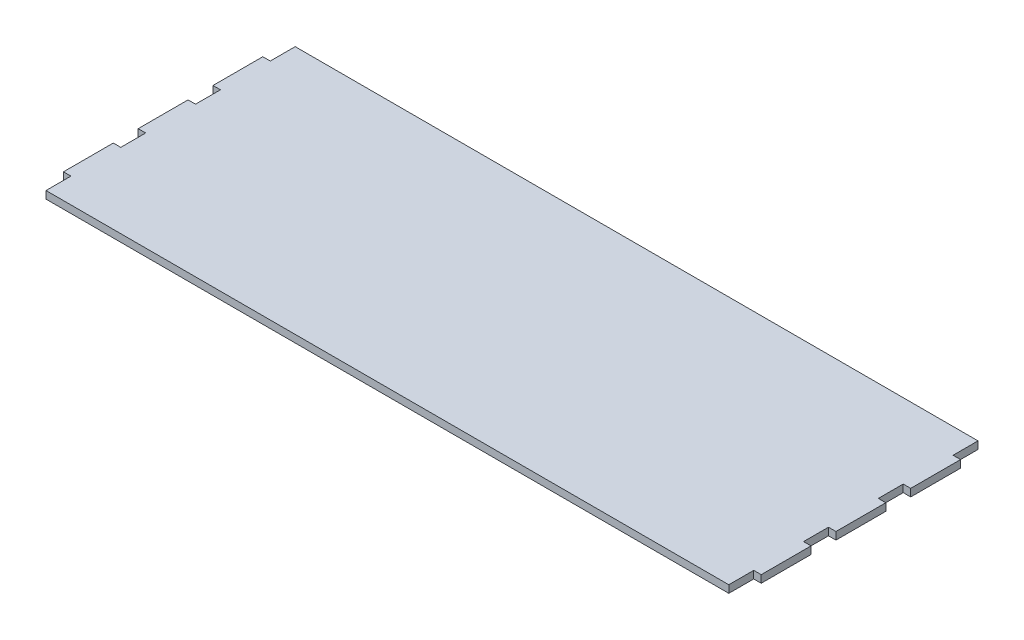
ISO-10303-21;
HEADER;
FILE_DESCRIPTION(('STEP AP214'),'2;1');
FILE_NAME('part.step','',(''),(''),'','','');
FILE_SCHEMA(('AUTOMOTIVE_DESIGN { 1 0 10303 214 1 1 1 1 }'));
ENDSEC;
DATA;
#1=APPLICATION_CONTEXT('core data for automotive mechanical design processes');
#2=APPLICATION_PROTOCOL_DEFINITION('international standard','automotive_design',2000,#1);
#3=PRODUCT_CONTEXT('',#1,'mechanical');
#4=PRODUCT('Part','Part','',(#3));
#5=PRODUCT_RELATED_PRODUCT_CATEGORY('part','',(#4));
#6=PRODUCT_DEFINITION_FORMATION('','',#4);
#7=PRODUCT_DEFINITION_CONTEXT('part definition',#1,'design');
#8=PRODUCT_DEFINITION('design','',#6,#7);
#9=PRODUCT_DEFINITION_SHAPE('','',#8);
#10=(LENGTH_UNIT() NAMED_UNIT(*) SI_UNIT(.MILLI.,.METRE.));
#11=(NAMED_UNIT(*) PLANE_ANGLE_UNIT() SI_UNIT($,.RADIAN.));
#12=(NAMED_UNIT(*) SI_UNIT($,.STERADIAN.) SOLID_ANGLE_UNIT());
#13=UNCERTAINTY_MEASURE_WITH_UNIT(LENGTH_MEASURE(1.E-05),#10,'distance_accuracy_value','');
#14=(GEOMETRIC_REPRESENTATION_CONTEXT(3) GLOBAL_UNCERTAINTY_ASSIGNED_CONTEXT((#13)) GLOBAL_UNIT_ASSIGNED_CONTEXT((#10,
#11,#12)) REPRESENTATION_CONTEXT('',''));
#15=CARTESIAN_POINT('',(0.,0.,0.));
#16=DIRECTION('',(0.,0.,1.));
#17=DIRECTION('',(1.,0.,0.));
#18=AXIS2_PLACEMENT_3D('',#15,#16,#17);
#19=CARTESIAN_POINT('',(548.000000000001,12.,-159.999999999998));
#20=DIRECTION('',(-1.,0.,0.));
#21=DIRECTION('',(0.,0.,1.));
#22=AXIS2_PLACEMENT_3D('',#19,#20,#21);
#23=PLANE('',#22);
#24=DIRECTION('',(0.,0.,-1.));
#25=VECTOR('',#24,1.);
#26=CARTESIAN_POINT('',(548.000000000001,0.,-159.999999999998));
#27=LINE('',#26,#25);
#28=CARTESIAN_POINT('',(548.000000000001,0.,-159.999999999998));
#29=VERTEX_POINT('',#28);
#30=CARTESIAN_POINT('',(548.,0.,-200.));
#31=VERTEX_POINT('',#30);
#32=EDGE_CURVE('E266',#29,#31,#27,.T.);
#33=ORIENTED_EDGE('',*,*,#32,.T.);
#34=DIRECTION('',(0.,-1.,0.));
#35=VECTOR('',#34,1.);
#36=CARTESIAN_POINT('',(548.,12.,-200.));
#37=LINE('',#36,#35);
#38=CARTESIAN_POINT('',(548.,12.,-200.));
#39=VERTEX_POINT('',#38);
#40=EDGE_CURVE('E11',#39,#31,#37,.T.);
#41=ORIENTED_EDGE('',*,*,#40,.F.);
#42=DIRECTION('',(0.,0.,-1.));
#43=VECTOR('',#42,1.);
#44=CARTESIAN_POINT('',(548.000000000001,12.,-159.999999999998));
#45=LINE('',#44,#43);
#46=CARTESIAN_POINT('',(548.000000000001,12.,-159.999999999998));
#47=VERTEX_POINT('',#46);
#48=EDGE_CURVE('E348',#47,#39,#45,.T.);
#49=ORIENTED_EDGE('',*,*,#48,.F.);
#50=DIRECTION('',(0.,-1.,0.));
#51=VECTOR('',#50,1.);
#52=CARTESIAN_POINT('',(548.000000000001,12.,-159.999999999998));
#53=LINE('',#52,#51);
#54=EDGE_CURVE('E262',#47,#29,#53,.T.);
#55=ORIENTED_EDGE('',*,*,#54,.T.);
#56=EDGE_LOOP('',(#33,#41,#49,#55));
#57=FACE_BOUND('',#56,.T.);
#58=ADVANCED_FACE('F45',(#57),#23,.F.);
#59=CARTESIAN_POINT('',(-548.,12.,-200.));
#60=DIRECTION('',(0.,0.,1.));
#61=DIRECTION('',(1.,0.,0.));
#62=AXIS2_PLACEMENT_3D('',#59,#60,#61);
#63=PLANE('',#62);
#64=DIRECTION('',(-1.,0.,0.));
#65=VECTOR('',#64,1.);
#66=CARTESIAN_POINT('',(-548.,0.,-200.));
#67=LINE('',#66,#65);
#68=CARTESIAN_POINT('',(-548.,0.,-200.));
#69=VERTEX_POINT('',#68);
#70=EDGE_CURVE('E270',#31,#69,#67,.T.);
#71=ORIENTED_EDGE('',*,*,#70,.T.);
#72=DIRECTION('',(0.,-1.,0.));
#73=VECTOR('',#72,1.);
#74=CARTESIAN_POINT('',(-548.,12.,-200.));
#75=LINE('',#74,#73);
#76=CARTESIAN_POINT('',(-548.,12.,-200.));
#77=VERTEX_POINT('',#76);
#78=EDGE_CURVE('E54',#77,#69,#75,.T.);
#79=ORIENTED_EDGE('',*,*,#78,.F.);
#80=DIRECTION('',(-1.,0.,0.));
#81=VECTOR('',#80,1.);
#82=CARTESIAN_POINT('',(-548.,12.,-200.));
#83=LINE('',#82,#81);
#84=EDGE_CURVE('E165',#39,#77,#83,.T.);
#85=ORIENTED_EDGE('',*,*,#84,.F.);
#86=ORIENTED_EDGE('',*,*,#40,.T.);
#87=EDGE_LOOP('',(#71,#79,#85,#86));
#88=FACE_BOUND('',#87,.T.);
#89=ADVANCED_FACE('F554',(#88),#63,.F.);
#90=CARTESIAN_POINT('',(-548.000000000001,12.,-160.));
#91=DIRECTION('',(1.,0.,0.));
#92=DIRECTION('',(0.,0.,-1.));
#93=AXIS2_PLACEMENT_3D('',#90,#91,#92);
#94=PLANE('',#93);
#95=DIRECTION('',(0.,0.,1.));
#96=VECTOR('',#95,1.);
#97=CARTESIAN_POINT('',(-548.000000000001,0.,-160.));
#98=LINE('',#97,#96);
#99=CARTESIAN_POINT('',(-548.000000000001,0.,-160.));
#100=VERTEX_POINT('',#99);
#101=EDGE_CURVE('E273',#69,#100,#98,.T.);
#102=ORIENTED_EDGE('',*,*,#101,.T.);
#103=DIRECTION('',(0.,-1.,0.));
#104=VECTOR('',#103,1.);
#105=CARTESIAN_POINT('',(-548.000000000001,12.,-160.));
#106=LINE('',#105,#104);
#107=CARTESIAN_POINT('',(-548.000000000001,12.,-160.));
#108=VERTEX_POINT('',#107);
#109=EDGE_CURVE('E439',#108,#100,#106,.T.);
#110=ORIENTED_EDGE('',*,*,#109,.F.);
#111=DIRECTION('',(0.,0.,1.));
#112=VECTOR('',#111,1.);
#113=CARTESIAN_POINT('',(-548.000000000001,12.,-160.));
#114=LINE('',#113,#112);
#115=EDGE_CURVE('E449',#77,#108,#114,.T.);
#116=ORIENTED_EDGE('',*,*,#115,.F.);
#117=ORIENTED_EDGE('',*,*,#78,.T.);
#118=EDGE_LOOP('',(#102,#110,#116,#117));
#119=FACE_BOUND('',#118,.T.);
#120=ADVANCED_FACE('F447',(#119),#94,.F.);
#121=CARTESIAN_POINT('',(-548.000000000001,12.,-160.));
#122=DIRECTION('',(0.,0.,1.));
#123=DIRECTION('',(1.,0.,0.));
#124=AXIS2_PLACEMENT_3D('',#121,#122,#123);
#125=PLANE('',#124);
#126=DIRECTION('',(-1.,0.,0.));
#127=VECTOR('',#126,1.);
#128=CARTESIAN_POINT('',(-548.000000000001,0.,-160.));
#129=LINE('',#128,#127);
#130=CARTESIAN_POINT('',(-560.000000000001,0.,-160.));
#131=VERTEX_POINT('',#130);
#132=EDGE_CURVE('E276',#100,#131,#129,.T.);
#133=ORIENTED_EDGE('',*,*,#132,.T.);
#134=DIRECTION('',(0.,-1.,0.));
#135=VECTOR('',#134,1.);
#136=CARTESIAN_POINT('',(-560.000000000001,12.,-160.));
#137=LINE('',#136,#135);
#138=CARTESIAN_POINT('',(-560.000000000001,12.,-160.));
#139=VERTEX_POINT('',#138);
#140=EDGE_CURVE('E435',#139,#131,#137,.T.);
#141=ORIENTED_EDGE('',*,*,#140,.F.);
#142=DIRECTION('',(-1.,0.,0.));
#143=VECTOR('',#142,1.);
#144=CARTESIAN_POINT('',(-548.000000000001,12.,-160.));
#145=LINE('',#144,#143);
#146=EDGE_CURVE('E468',#108,#139,#145,.T.);
#147=ORIENTED_EDGE('',*,*,#146,.F.);
#148=ORIENTED_EDGE('',*,*,#109,.T.);
#149=EDGE_LOOP('',(#133,#141,#147,#148));
#150=FACE_BOUND('',#149,.T.);
#151=ADVANCED_FACE('F458',(#150),#125,.F.);
#152=CARTESIAN_POINT('',(-560.000000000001,12.,-80.));
#153=DIRECTION('',(1.,0.,0.));
#154=DIRECTION('',(0.,0.,-1.));
#155=AXIS2_PLACEMENT_3D('',#152,#153,#154);
#156=PLANE('',#155);
#157=DIRECTION('',(0.,0.,1.));
#158=VECTOR('',#157,1.);
#159=CARTESIAN_POINT('',(-560.000000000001,0.,-80.));
#160=LINE('',#159,#158);
#161=CARTESIAN_POINT('',(-560.000000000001,0.,-80.));
#162=VERTEX_POINT('',#161);
#163=EDGE_CURVE('E279',#131,#162,#160,.T.);
#164=ORIENTED_EDGE('',*,*,#163,.T.);
#165=DIRECTION('',(0.,-1.,0.));
#166=VECTOR('',#165,1.);
#167=CARTESIAN_POINT('',(-560.000000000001,12.,-80.));
#168=LINE('',#167,#166);
#169=CARTESIAN_POINT('',(-560.000000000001,12.,-80.));
#170=VERTEX_POINT('',#169);
#171=EDGE_CURVE('E431',#170,#162,#168,.T.);
#172=ORIENTED_EDGE('',*,*,#171,.F.);
#173=DIRECTION('',(0.,0.,1.));
#174=VECTOR('',#173,1.);
#175=CARTESIAN_POINT('',(-560.000000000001,12.,-80.));
#176=LINE('',#175,#174);
#177=EDGE_CURVE('E464',#139,#170,#176,.T.);
#178=ORIENTED_EDGE('',*,*,#177,.F.);
#179=ORIENTED_EDGE('',*,*,#140,.T.);
#180=EDGE_LOOP('',(#164,#172,#178,#179));
#181=FACE_BOUND('',#180,.T.);
#182=ADVANCED_FACE('F462',(#181),#156,.F.);
#183=CARTESIAN_POINT('',(-548.000000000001,12.,-80.));
#184=DIRECTION('',(0.,0.,-1.));
#185=DIRECTION('',(-1.,0.,0.));
#186=AXIS2_PLACEMENT_3D('',#183,#184,#185);
#187=PLANE('',#186);
#188=DIRECTION('',(1.,0.,0.));
#189=VECTOR('',#188,1.);
#190=CARTESIAN_POINT('',(-548.000000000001,0.,-80.));
#191=LINE('',#190,#189);
#192=CARTESIAN_POINT('',(-548.000000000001,0.,-80.));
#193=VERTEX_POINT('',#192);
#194=EDGE_CURVE('E282',#162,#193,#191,.T.);
#195=ORIENTED_EDGE('',*,*,#194,.T.);
#196=DIRECTION('',(0.,-1.,0.));
#197=VECTOR('',#196,1.);
#198=CARTESIAN_POINT('',(-548.000000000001,12.,-80.));
#199=LINE('',#198,#197);
#200=CARTESIAN_POINT('',(-548.000000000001,12.,-80.));
#201=VERTEX_POINT('',#200);
#202=EDGE_CURVE('E427',#201,#193,#199,.T.);
#203=ORIENTED_EDGE('',*,*,#202,.F.);
#204=DIRECTION('',(1.,0.,0.));
#205=VECTOR('',#204,1.);
#206=CARTESIAN_POINT('',(-548.000000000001,12.,-80.));
#207=LINE('',#206,#205);
#208=EDGE_CURVE('E467',#170,#201,#207,.T.);
#209=ORIENTED_EDGE('',*,*,#208,.F.);
#210=ORIENTED_EDGE('',*,*,#171,.T.);
#211=EDGE_LOOP('',(#195,#203,#209,#210));
#212=FACE_BOUND('',#211,.T.);
#213=ADVANCED_FACE('F567',(#212),#187,.F.);
#214=CARTESIAN_POINT('',(-548.,12.,-40.));
#215=DIRECTION('',(1.,0.,0.));
#216=DIRECTION('',(0.,0.,-1.));
#217=AXIS2_PLACEMENT_3D('',#214,#215,#216);
#218=PLANE('',#217);
#219=DIRECTION('',(0.,0.,1.));
#220=VECTOR('',#219,1.);
#221=CARTESIAN_POINT('',(-548.,0.,-40.));
#222=LINE('',#221,#220);
#223=CARTESIAN_POINT('',(-548.,0.,-40.));
#224=VERTEX_POINT('',#223);
#225=EDGE_CURVE('E285',#193,#224,#222,.T.);
#226=ORIENTED_EDGE('',*,*,#225,.T.);
#227=DIRECTION('',(0.,-1.,0.));
#228=VECTOR('',#227,1.);
#229=CARTESIAN_POINT('',(-548.,12.,-40.));
#230=LINE('',#229,#228);
#231=CARTESIAN_POINT('',(-548.,12.,-40.));
#232=VERTEX_POINT('',#231);
#233=EDGE_CURVE('E423',#232,#224,#230,.T.);
#234=ORIENTED_EDGE('',*,*,#233,.F.);
#235=DIRECTION('',(0.,0.,1.));
#236=VECTOR('',#235,1.);
#237=CARTESIAN_POINT('',(-548.,12.,-40.));
#238=LINE('',#237,#236);
#239=EDGE_CURVE('E472',#201,#232,#238,.T.);
#240=ORIENTED_EDGE('',*,*,#239,.F.);
#241=ORIENTED_EDGE('',*,*,#202,.T.);
#242=EDGE_LOOP('',(#226,#234,#240,#241));
#243=FACE_BOUND('',#242,.T.);
#244=ADVANCED_FACE('F570',(#243),#218,.F.);
#245=CARTESIAN_POINT('',(-548.,12.,-40.));
#246=DIRECTION('',(0.,0.,1.));
#247=DIRECTION('',(1.,0.,0.));
#248=AXIS2_PLACEMENT_3D('',#245,#246,#247);
#249=PLANE('',#248);
#250=DIRECTION('',(-1.,0.,0.));
#251=VECTOR('',#250,1.);
#252=CARTESIAN_POINT('',(-548.,0.,-40.));
#253=LINE('',#252,#251);
#254=CARTESIAN_POINT('',(-560.,0.,-40.));
#255=VERTEX_POINT('',#254);
#256=EDGE_CURVE('E288',#224,#255,#253,.T.);
#257=ORIENTED_EDGE('',*,*,#256,.T.);
#258=DIRECTION('',(0.,-1.,0.));
#259=VECTOR('',#258,1.);
#260=CARTESIAN_POINT('',(-560.,12.,-40.));
#261=LINE('',#260,#259);
#262=CARTESIAN_POINT('',(-560.,12.,-40.));
#263=VERTEX_POINT('',#262);
#264=EDGE_CURVE('E419',#263,#255,#261,.T.);
#265=ORIENTED_EDGE('',*,*,#264,.F.);
#266=DIRECTION('',(-1.,0.,0.));
#267=VECTOR('',#266,1.);
#268=CARTESIAN_POINT('',(-548.,12.,-40.));
#269=LINE('',#268,#267);
#270=EDGE_CURVE('E479',#232,#263,#269,.T.);
#271=ORIENTED_EDGE('',*,*,#270,.F.);
#272=ORIENTED_EDGE('',*,*,#233,.T.);
#273=EDGE_LOOP('',(#257,#265,#271,#272));
#274=FACE_BOUND('',#273,.T.);
#275=ADVANCED_FACE('F574',(#274),#249,.F.);
#276=CARTESIAN_POINT('',(-560.,12.,40.));
#277=DIRECTION('',(1.,0.,0.));
#278=DIRECTION('',(0.,0.,-1.));
#279=AXIS2_PLACEMENT_3D('',#276,#277,#278);
#280=PLANE('',#279);
#281=DIRECTION('',(0.,0.,1.));
#282=VECTOR('',#281,1.);
#283=CARTESIAN_POINT('',(-560.,0.,40.));
#284=LINE('',#283,#282);
#285=CARTESIAN_POINT('',(-560.,0.,40.));
#286=VERTEX_POINT('',#285);
#287=EDGE_CURVE('E291',#255,#286,#284,.T.);
#288=ORIENTED_EDGE('',*,*,#287,.T.);
#289=DIRECTION('',(0.,-1.,0.));
#290=VECTOR('',#289,1.);
#291=CARTESIAN_POINT('',(-560.,12.,40.));
#292=LINE('',#291,#290);
#293=CARTESIAN_POINT('',(-560.,12.,40.));
#294=VERTEX_POINT('',#293);
#295=EDGE_CURVE('E415',#294,#286,#292,.T.);
#296=ORIENTED_EDGE('',*,*,#295,.F.);
#297=DIRECTION('',(0.,0.,1.));
#298=VECTOR('',#297,1.);
#299=CARTESIAN_POINT('',(-560.,12.,40.));
#300=LINE('',#299,#298);
#301=EDGE_CURVE('E482',#263,#294,#300,.T.);
#302=ORIENTED_EDGE('',*,*,#301,.F.);
#303=ORIENTED_EDGE('',*,*,#264,.T.);
#304=EDGE_LOOP('',(#288,#296,#302,#303));
#305=FACE_BOUND('',#304,.T.);
#306=ADVANCED_FACE('F578',(#305),#280,.F.);
#307=CARTESIAN_POINT('',(-548.,12.,40.));
#308=DIRECTION('',(0.,0.,-1.));
#309=DIRECTION('',(-1.,0.,0.));
#310=AXIS2_PLACEMENT_3D('',#307,#308,#309);
#311=PLANE('',#310);
#312=DIRECTION('',(1.,0.,0.));
#313=VECTOR('',#312,1.);
#314=CARTESIAN_POINT('',(-548.,0.,40.));
#315=LINE('',#314,#313);
#316=CARTESIAN_POINT('',(-548.,0.,40.));
#317=VERTEX_POINT('',#316);
#318=EDGE_CURVE('E294',#286,#317,#315,.T.);
#319=ORIENTED_EDGE('',*,*,#318,.T.);
#320=DIRECTION('',(0.,-1.,0.));
#321=VECTOR('',#320,1.);
#322=CARTESIAN_POINT('',(-548.,12.,40.));
#323=LINE('',#322,#321);
#324=CARTESIAN_POINT('',(-548.,12.,40.));
#325=VERTEX_POINT('',#324);
#326=EDGE_CURVE('E411',#325,#317,#323,.T.);
#327=ORIENTED_EDGE('',*,*,#326,.F.);
#328=DIRECTION('',(1.,0.,0.));
#329=VECTOR('',#328,1.);
#330=CARTESIAN_POINT('',(-548.,12.,40.));
#331=LINE('',#330,#329);
#332=EDGE_CURVE('E485',#294,#325,#331,.T.);
#333=ORIENTED_EDGE('',*,*,#332,.F.);
#334=ORIENTED_EDGE('',*,*,#295,.T.);
#335=EDGE_LOOP('',(#319,#327,#333,#334));
#336=FACE_BOUND('',#335,.T.);
#337=ADVANCED_FACE('F582',(#336),#311,.F.);
#338=CARTESIAN_POINT('',(-548.,12.,80.));
#339=DIRECTION('',(1.,0.,0.));
#340=DIRECTION('',(0.,0.,-1.));
#341=AXIS2_PLACEMENT_3D('',#338,#339,#340);
#342=PLANE('',#341);
#343=DIRECTION('',(0.,0.,1.));
#344=VECTOR('',#343,1.);
#345=CARTESIAN_POINT('',(-548.,0.,80.));
#346=LINE('',#345,#344);
#347=CARTESIAN_POINT('',(-548.,0.,80.));
#348=VERTEX_POINT('',#347);
#349=EDGE_CURVE('E297',#317,#348,#346,.T.);
#350=ORIENTED_EDGE('',*,*,#349,.T.);
#351=DIRECTION('',(0.,-1.,0.));
#352=VECTOR('',#351,1.);
#353=CARTESIAN_POINT('',(-548.,12.,80.));
#354=LINE('',#353,#352);
#355=CARTESIAN_POINT('',(-548.,12.,80.));
#356=VERTEX_POINT('',#355);
#357=EDGE_CURVE('E407',#356,#348,#354,.T.);
#358=ORIENTED_EDGE('',*,*,#357,.F.);
#359=DIRECTION('',(0.,0.,1.));
#360=VECTOR('',#359,1.);
#361=CARTESIAN_POINT('',(-548.,12.,80.));
#362=LINE('',#361,#360);
#363=EDGE_CURVE('E488',#325,#356,#362,.T.);
#364=ORIENTED_EDGE('',*,*,#363,.F.);
#365=ORIENTED_EDGE('',*,*,#326,.T.);
#366=EDGE_LOOP('',(#350,#358,#364,#365));
#367=FACE_BOUND('',#366,.T.);
#368=ADVANCED_FACE('F586',(#367),#342,.F.);
#369=CARTESIAN_POINT('',(-548.,12.,80.));
#370=DIRECTION('',(0.,0.,1.));
#371=DIRECTION('',(1.,0.,0.));
#372=AXIS2_PLACEMENT_3D('',#369,#370,#371);
#373=PLANE('',#372);
#374=DIRECTION('',(-1.,0.,0.));
#375=VECTOR('',#374,1.);
#376=CARTESIAN_POINT('',(-548.,0.,80.));
#377=LINE('',#376,#375);
#378=CARTESIAN_POINT('',(-560.,0.,80.));
#379=VERTEX_POINT('',#378);
#380=EDGE_CURVE('E300',#348,#379,#377,.T.);
#381=ORIENTED_EDGE('',*,*,#380,.T.);
#382=DIRECTION('',(0.,-1.,0.));
#383=VECTOR('',#382,1.);
#384=CARTESIAN_POINT('',(-560.,12.,80.));
#385=LINE('',#384,#383);
#386=CARTESIAN_POINT('',(-560.,12.,80.));
#387=VERTEX_POINT('',#386);
#388=EDGE_CURVE('E403',#387,#379,#385,.T.);
#389=ORIENTED_EDGE('',*,*,#388,.F.);
#390=DIRECTION('',(-1.,0.,0.));
#391=VECTOR('',#390,1.);
#392=CARTESIAN_POINT('',(-548.,12.,80.));
#393=LINE('',#392,#391);
#394=EDGE_CURVE('E491',#356,#387,#393,.T.);
#395=ORIENTED_EDGE('',*,*,#394,.F.);
#396=ORIENTED_EDGE('',*,*,#357,.T.);
#397=EDGE_LOOP('',(#381,#389,#395,#396));
#398=FACE_BOUND('',#397,.T.);
#399=ADVANCED_FACE('F590',(#398),#373,.F.);
#400=CARTESIAN_POINT('',(-560.,12.,160.));
#401=DIRECTION('',(1.,0.,0.));
#402=DIRECTION('',(0.,0.,-1.));
#403=AXIS2_PLACEMENT_3D('',#400,#401,#402);
#404=PLANE('',#403);
#405=DIRECTION('',(0.,0.,1.));
#406=VECTOR('',#405,1.);
#407=CARTESIAN_POINT('',(-560.,0.,160.));
#408=LINE('',#407,#406);
#409=CARTESIAN_POINT('',(-560.,0.,160.));
#410=VERTEX_POINT('',#409);
#411=EDGE_CURVE('E303',#379,#410,#408,.T.);
#412=ORIENTED_EDGE('',*,*,#411,.T.);
#413=DIRECTION('',(0.,-1.,0.));
#414=VECTOR('',#413,1.);
#415=CARTESIAN_POINT('',(-560.,12.,160.));
#416=LINE('',#415,#414);
#417=CARTESIAN_POINT('',(-560.,12.,160.));
#418=VERTEX_POINT('',#417);
#419=EDGE_CURVE('E399',#418,#410,#416,.T.);
#420=ORIENTED_EDGE('',*,*,#419,.F.);
#421=DIRECTION('',(0.,0.,1.));
#422=VECTOR('',#421,1.);
#423=CARTESIAN_POINT('',(-560.,12.,160.));
#424=LINE('',#423,#422);
#425=EDGE_CURVE('E494',#387,#418,#424,.T.);
#426=ORIENTED_EDGE('',*,*,#425,.F.);
#427=ORIENTED_EDGE('',*,*,#388,.T.);
#428=EDGE_LOOP('',(#412,#420,#426,#427));
#429=FACE_BOUND('',#428,.T.);
#430=ADVANCED_FACE('F594',(#429),#404,.F.);
#431=CARTESIAN_POINT('',(-548.,12.,160.));
#432=DIRECTION('',(0.,0.,-1.));
#433=DIRECTION('',(-1.,0.,0.));
#434=AXIS2_PLACEMENT_3D('',#431,#432,#433);
#435=PLANE('',#434);
#436=DIRECTION('',(1.,0.,0.));
#437=VECTOR('',#436,1.);
#438=CARTESIAN_POINT('',(-548.,0.,160.));
#439=LINE('',#438,#437);
#440=CARTESIAN_POINT('',(-548.,0.,160.));
#441=VERTEX_POINT('',#440);
#442=EDGE_CURVE('E306',#410,#441,#439,.T.);
#443=ORIENTED_EDGE('',*,*,#442,.T.);
#444=DIRECTION('',(0.,-1.,0.));
#445=VECTOR('',#444,1.);
#446=CARTESIAN_POINT('',(-548.,12.,160.));
#447=LINE('',#446,#445);
#448=CARTESIAN_POINT('',(-548.,12.,160.));
#449=VERTEX_POINT('',#448);
#450=EDGE_CURVE('E395',#449,#441,#447,.T.);
#451=ORIENTED_EDGE('',*,*,#450,.F.);
#452=DIRECTION('',(1.,0.,0.));
#453=VECTOR('',#452,1.);
#454=CARTESIAN_POINT('',(-548.,12.,160.));
#455=LINE('',#454,#453);
#456=EDGE_CURVE('E497',#418,#449,#455,.T.);
#457=ORIENTED_EDGE('',*,*,#456,.F.);
#458=ORIENTED_EDGE('',*,*,#419,.T.);
#459=EDGE_LOOP('',(#443,#451,#457,#458));
#460=FACE_BOUND('',#459,.T.);
#461=ADVANCED_FACE('F598',(#460),#435,.F.);
#462=CARTESIAN_POINT('',(-548.,12.,200.));
#463=DIRECTION('',(1.,0.,0.));
#464=DIRECTION('',(0.,0.,-1.));
#465=AXIS2_PLACEMENT_3D('',#462,#463,#464);
#466=PLANE('',#465);
#467=DIRECTION('',(0.,0.,1.));
#468=VECTOR('',#467,1.);
#469=CARTESIAN_POINT('',(-548.,0.,200.));
#470=LINE('',#469,#468);
#471=CARTESIAN_POINT('',(-548.,0.,200.));
#472=VERTEX_POINT('',#471);
#473=EDGE_CURVE('E309',#441,#472,#470,.T.);
#474=ORIENTED_EDGE('',*,*,#473,.T.);
#475=DIRECTION('',(0.,-1.,0.));
#476=VECTOR('',#475,1.);
#477=CARTESIAN_POINT('',(-548.,12.,200.));
#478=LINE('',#477,#476);
#479=CARTESIAN_POINT('',(-548.,12.,200.));
#480=VERTEX_POINT('',#479);
#481=EDGE_CURVE('E391',#480,#472,#478,.T.);
#482=ORIENTED_EDGE('',*,*,#481,.F.);
#483=DIRECTION('',(0.,0.,1.));
#484=VECTOR('',#483,1.);
#485=CARTESIAN_POINT('',(-548.,12.,200.));
#486=LINE('',#485,#484);
#487=EDGE_CURVE('E500',#449,#480,#486,.T.);
#488=ORIENTED_EDGE('',*,*,#487,.F.);
#489=ORIENTED_EDGE('',*,*,#450,.T.);
#490=EDGE_LOOP('',(#474,#482,#488,#489));
#491=FACE_BOUND('',#490,.T.);
#492=ADVANCED_FACE('F602',(#491),#466,.F.);
#493=CARTESIAN_POINT('',(-548.,12.,200.));
#494=DIRECTION('',(0.,0.,-1.));
#495=DIRECTION('',(-1.,0.,0.));
#496=AXIS2_PLACEMENT_3D('',#493,#494,#495);
#497=PLANE('',#496);
#498=DIRECTION('',(1.,0.,0.));
#499=VECTOR('',#498,1.);
#500=CARTESIAN_POINT('',(-548.,0.,200.));
#501=LINE('',#500,#499);
#502=CARTESIAN_POINT('',(548.,0.,200.));
#503=VERTEX_POINT('',#502);
#504=EDGE_CURVE('E312',#472,#503,#501,.T.);
#505=ORIENTED_EDGE('',*,*,#504,.T.);
#506=DIRECTION('',(0.,-1.,0.));
#507=VECTOR('',#506,1.);
#508=CARTESIAN_POINT('',(548.,12.,200.));
#509=LINE('',#508,#507);
#510=CARTESIAN_POINT('',(548.,12.,200.));
#511=VERTEX_POINT('',#510);
#512=EDGE_CURVE('E387',#511,#503,#509,.T.);
#513=ORIENTED_EDGE('',*,*,#512,.F.);
#514=DIRECTION('',(1.,0.,0.));
#515=VECTOR('',#514,1.);
#516=CARTESIAN_POINT('',(-548.,12.,200.));
#517=LINE('',#516,#515);
#518=EDGE_CURVE('E503',#480,#511,#517,.T.);
#519=ORIENTED_EDGE('',*,*,#518,.F.);
#520=ORIENTED_EDGE('',*,*,#481,.T.);
#521=EDGE_LOOP('',(#505,#513,#519,#520));
#522=FACE_BOUND('',#521,.T.);
#523=ADVANCED_FACE('F606',(#522),#497,.F.);
#524=CARTESIAN_POINT('',(548.,12.,200.));
#525=DIRECTION('',(-1.,0.,0.));
#526=DIRECTION('',(0.,0.,1.));
#527=AXIS2_PLACEMENT_3D('',#524,#525,#526);
#528=PLANE('',#527);
#529=DIRECTION('',(0.,0.,-1.));
#530=VECTOR('',#529,1.);
#531=CARTESIAN_POINT('',(548.,0.,200.));
#532=LINE('',#531,#530);
#533=CARTESIAN_POINT('',(547.999999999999,0.,160.000000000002));
#534=VERTEX_POINT('',#533);
#535=EDGE_CURVE('E315',#503,#534,#532,.T.);
#536=ORIENTED_EDGE('',*,*,#535,.T.);
#537=DIRECTION('',(0.,-1.,0.));
#538=VECTOR('',#537,1.);
#539=CARTESIAN_POINT('',(547.999999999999,12.,160.000000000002));
#540=LINE('',#539,#538);
#541=CARTESIAN_POINT('',(547.999999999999,12.,160.000000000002));
#542=VERTEX_POINT('',#541);
#543=EDGE_CURVE('E383',#542,#534,#540,.T.);
#544=ORIENTED_EDGE('',*,*,#543,.F.);
#545=DIRECTION('',(0.,0.,-1.));
#546=VECTOR('',#545,1.);
#547=CARTESIAN_POINT('',(548.,12.,200.));
#548=LINE('',#547,#546);
#549=EDGE_CURVE('E506',#511,#542,#548,.T.);
#550=ORIENTED_EDGE('',*,*,#549,.F.);
#551=ORIENTED_EDGE('',*,*,#512,.T.);
#552=EDGE_LOOP('',(#536,#544,#550,#551));
#553=FACE_BOUND('',#552,.T.);
#554=ADVANCED_FACE('F610',(#553),#528,.F.);
#555=CARTESIAN_POINT('',(547.999999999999,12.,160.000000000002));
#556=DIRECTION('',(0.,0.,-1.));
#557=DIRECTION('',(-1.,0.,0.));
#558=AXIS2_PLACEMENT_3D('',#555,#556,#557);
#559=PLANE('',#558);
#560=DIRECTION('',(1.,0.,0.));
#561=VECTOR('',#560,1.);
#562=CARTESIAN_POINT('',(547.999999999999,0.,160.000000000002));
#563=LINE('',#562,#561);
#564=CARTESIAN_POINT('',(559.999999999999,0.,160.000000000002));
#565=VERTEX_POINT('',#564);
#566=EDGE_CURVE('E318',#534,#565,#563,.T.);
#567=ORIENTED_EDGE('',*,*,#566,.T.);
#568=DIRECTION('',(0.,-1.,0.));
#569=VECTOR('',#568,1.);
#570=CARTESIAN_POINT('',(559.999999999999,12.,160.000000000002));
#571=LINE('',#570,#569);
#572=CARTESIAN_POINT('',(559.999999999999,12.,160.000000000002));
#573=VERTEX_POINT('',#572);
#574=EDGE_CURVE('E379',#573,#565,#571,.T.);
#575=ORIENTED_EDGE('',*,*,#574,.F.);
#576=DIRECTION('',(1.,0.,0.));
#577=VECTOR('',#576,1.);
#578=CARTESIAN_POINT('',(547.999999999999,12.,160.000000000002));
#579=LINE('',#578,#577);
#580=EDGE_CURVE('E509',#542,#573,#579,.T.);
#581=ORIENTED_EDGE('',*,*,#580,.F.);
#582=ORIENTED_EDGE('',*,*,#543,.T.);
#583=EDGE_LOOP('',(#567,#575,#581,#582));
#584=FACE_BOUND('',#583,.T.);
#585=ADVANCED_FACE('F614',(#584),#559,.F.);
#586=CARTESIAN_POINT('',(559.999999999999,12.,160.000000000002));
#587=DIRECTION('',(-1.,0.,0.));
#588=DIRECTION('',(0.,0.,1.));
#589=AXIS2_PLACEMENT_3D('',#586,#587,#588);
#590=PLANE('',#589);
#591=DIRECTION('',(0.,0.,-1.));
#592=VECTOR('',#591,1.);
#593=CARTESIAN_POINT('',(559.999999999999,0.,160.000000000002));
#594=LINE('',#593,#592);
#595=CARTESIAN_POINT('',(559.999999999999,0.,80.0000000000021));
#596=VERTEX_POINT('',#595);
#597=EDGE_CURVE('E321',#565,#596,#594,.T.);
#598=ORIENTED_EDGE('',*,*,#597,.T.);
#599=DIRECTION('',(0.,-1.,0.));
#600=VECTOR('',#599,1.);
#601=CARTESIAN_POINT('',(559.999999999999,12.,80.0000000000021));
#602=LINE('',#601,#600);
#603=CARTESIAN_POINT('',(559.999999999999,12.,80.0000000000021));
#604=VERTEX_POINT('',#603);
#605=EDGE_CURVE('E375',#604,#596,#602,.T.);
#606=ORIENTED_EDGE('',*,*,#605,.F.);
#607=DIRECTION('',(0.,0.,-1.));
#608=VECTOR('',#607,1.);
#609=CARTESIAN_POINT('',(559.999999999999,12.,160.000000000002));
#610=LINE('',#609,#608);
#611=EDGE_CURVE('E512',#573,#604,#610,.T.);
#612=ORIENTED_EDGE('',*,*,#611,.F.);
#613=ORIENTED_EDGE('',*,*,#574,.T.);
#614=EDGE_LOOP('',(#598,#606,#612,#613));
#615=FACE_BOUND('',#614,.T.);
#616=ADVANCED_FACE('F618',(#615),#590,.F.);
#617=CARTESIAN_POINT('',(547.999999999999,12.,80.0000000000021));
#618=DIRECTION('',(0.,0.,1.));
#619=DIRECTION('',(1.,0.,0.));
#620=AXIS2_PLACEMENT_3D('',#617,#618,#619);
#621=PLANE('',#620);
#622=DIRECTION('',(-1.,0.,0.));
#623=VECTOR('',#622,1.);
#624=CARTESIAN_POINT('',(547.999999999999,0.,80.0000000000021));
#625=LINE('',#624,#623);
#626=CARTESIAN_POINT('',(547.999999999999,0.,80.0000000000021));
#627=VERTEX_POINT('',#626);
#628=EDGE_CURVE('E324',#596,#627,#625,.T.);
#629=ORIENTED_EDGE('',*,*,#628,.T.);
#630=DIRECTION('',(0.,-1.,0.));
#631=VECTOR('',#630,1.);
#632=CARTESIAN_POINT('',(547.999999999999,12.,80.0000000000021));
#633=LINE('',#632,#631);
#634=CARTESIAN_POINT('',(547.999999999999,12.,80.0000000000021));
#635=VERTEX_POINT('',#634);
#636=EDGE_CURVE('E371',#635,#627,#633,.T.);
#637=ORIENTED_EDGE('',*,*,#636,.F.);
#638=DIRECTION('',(-1.,0.,0.));
#639=VECTOR('',#638,1.);
#640=CARTESIAN_POINT('',(547.999999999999,12.,80.0000000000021));
#641=LINE('',#640,#639);
#642=EDGE_CURVE('E515',#604,#635,#641,.T.);
#643=ORIENTED_EDGE('',*,*,#642,.F.);
#644=ORIENTED_EDGE('',*,*,#605,.T.);
#645=EDGE_LOOP('',(#629,#637,#643,#644));
#646=FACE_BOUND('',#645,.T.);
#647=ADVANCED_FACE('F622',(#646),#621,.F.);
#648=CARTESIAN_POINT('',(547.999999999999,12.,80.0000000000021));
#649=DIRECTION('',(-1.,0.,0.));
#650=DIRECTION('',(0.,0.,1.));
#651=AXIS2_PLACEMENT_3D('',#648,#649,#650);
#652=PLANE('',#651);
#653=DIRECTION('',(0.,0.,-1.));
#654=VECTOR('',#653,1.);
#655=CARTESIAN_POINT('',(547.999999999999,0.,80.0000000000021));
#656=LINE('',#655,#654);
#657=CARTESIAN_POINT('',(548.,0.,40.0000000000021));
#658=VERTEX_POINT('',#657);
#659=EDGE_CURVE('E327',#627,#658,#656,.T.);
#660=ORIENTED_EDGE('',*,*,#659,.T.);
#661=DIRECTION('',(0.,-1.,0.));
#662=VECTOR('',#661,1.);
#663=CARTESIAN_POINT('',(548.,12.,40.0000000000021));
#664=LINE('',#663,#662);
#665=CARTESIAN_POINT('',(548.,12.,40.0000000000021));
#666=VERTEX_POINT('',#665);
#667=EDGE_CURVE('E367',#666,#658,#664,.T.);
#668=ORIENTED_EDGE('',*,*,#667,.F.);
#669=DIRECTION('',(0.,0.,-1.));
#670=VECTOR('',#669,1.);
#671=CARTESIAN_POINT('',(547.999999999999,12.,80.0000000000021));
#672=LINE('',#671,#670);
#673=EDGE_CURVE('E518',#635,#666,#672,.T.);
#674=ORIENTED_EDGE('',*,*,#673,.F.);
#675=ORIENTED_EDGE('',*,*,#636,.T.);
#676=EDGE_LOOP('',(#660,#668,#674,#675));
#677=FACE_BOUND('',#676,.T.);
#678=ADVANCED_FACE('F626',(#677),#652,.F.);
#679=CARTESIAN_POINT('',(548.,12.,40.0000000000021));
#680=DIRECTION('',(0.,0.,-1.));
#681=DIRECTION('',(-1.,0.,0.));
#682=AXIS2_PLACEMENT_3D('',#679,#680,#681);
#683=PLANE('',#682);
#684=DIRECTION('',(1.,0.,0.));
#685=VECTOR('',#684,1.);
#686=CARTESIAN_POINT('',(548.,0.,40.0000000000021));
#687=LINE('',#686,#685);
#688=CARTESIAN_POINT('',(560.,0.,40.0000000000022));
#689=VERTEX_POINT('',#688);
#690=EDGE_CURVE('E330',#658,#689,#687,.T.);
#691=ORIENTED_EDGE('',*,*,#690,.T.);
#692=DIRECTION('',(0.,-1.,0.));
#693=VECTOR('',#692,1.);
#694=CARTESIAN_POINT('',(560.,12.,40.0000000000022));
#695=LINE('',#694,#693);
#696=CARTESIAN_POINT('',(560.,12.,40.0000000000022));
#697=VERTEX_POINT('',#696);
#698=EDGE_CURVE('E363',#697,#689,#695,.T.);
#699=ORIENTED_EDGE('',*,*,#698,.F.);
#700=DIRECTION('',(1.,0.,0.));
#701=VECTOR('',#700,1.);
#702=CARTESIAN_POINT('',(548.,12.,40.0000000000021));
#703=LINE('',#702,#701);
#704=EDGE_CURVE('E521',#666,#697,#703,.T.);
#705=ORIENTED_EDGE('',*,*,#704,.F.);
#706=ORIENTED_EDGE('',*,*,#667,.T.);
#707=EDGE_LOOP('',(#691,#699,#705,#706));
#708=FACE_BOUND('',#707,.T.);
#709=ADVANCED_FACE('F630',(#708),#683,.F.);
#710=CARTESIAN_POINT('',(560.,12.,40.0000000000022));
#711=DIRECTION('',(-1.,0.,0.));
#712=DIRECTION('',(0.,0.,1.));
#713=AXIS2_PLACEMENT_3D('',#710,#711,#712);
#714=PLANE('',#713);
#715=DIRECTION('',(0.,0.,-1.));
#716=VECTOR('',#715,1.);
#717=CARTESIAN_POINT('',(560.,0.,40.0000000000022));
#718=LINE('',#717,#716);
#719=CARTESIAN_POINT('',(560.,0.,-39.9999999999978));
#720=VERTEX_POINT('',#719);
#721=EDGE_CURVE('E333',#689,#720,#718,.T.);
#722=ORIENTED_EDGE('',*,*,#721,.T.);
#723=DIRECTION('',(0.,-1.,0.));
#724=VECTOR('',#723,1.);
#725=CARTESIAN_POINT('',(560.,12.,-39.9999999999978));
#726=LINE('',#725,#724);
#727=CARTESIAN_POINT('',(560.,12.,-39.9999999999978));
#728=VERTEX_POINT('',#727);
#729=EDGE_CURVE('E359',#728,#720,#726,.T.);
#730=ORIENTED_EDGE('',*,*,#729,.F.);
#731=DIRECTION('',(0.,0.,-1.));
#732=VECTOR('',#731,1.);
#733=CARTESIAN_POINT('',(560.,12.,40.0000000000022));
#734=LINE('',#733,#732);
#735=EDGE_CURVE('E524',#697,#728,#734,.T.);
#736=ORIENTED_EDGE('',*,*,#735,.F.);
#737=ORIENTED_EDGE('',*,*,#698,.T.);
#738=EDGE_LOOP('',(#722,#730,#736,#737));
#739=FACE_BOUND('',#738,.T.);
#740=ADVANCED_FACE('F634',(#739),#714,.F.);
#741=CARTESIAN_POINT('',(548.,12.,-39.9999999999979));
#742=DIRECTION('',(0.,0.,1.));
#743=DIRECTION('',(1.,0.,0.));
#744=AXIS2_PLACEMENT_3D('',#741,#742,#743);
#745=PLANE('',#744);
#746=DIRECTION('',(-1.,0.,0.));
#747=VECTOR('',#746,1.);
#748=CARTESIAN_POINT('',(548.,0.,-39.9999999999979));
#749=LINE('',#748,#747);
#750=CARTESIAN_POINT('',(548.,0.,-39.9999999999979));
#751=VERTEX_POINT('',#750);
#752=EDGE_CURVE('E336',#720,#751,#749,.T.);
#753=ORIENTED_EDGE('',*,*,#752,.T.);
#754=DIRECTION('',(0.,-1.,0.));
#755=VECTOR('',#754,1.);
#756=CARTESIAN_POINT('',(548.,12.,-39.9999999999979));
#757=LINE('',#756,#755);
#758=CARTESIAN_POINT('',(548.,12.,-39.9999999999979));
#759=VERTEX_POINT('',#758);
#760=EDGE_CURVE('E355',#759,#751,#757,.T.);
#761=ORIENTED_EDGE('',*,*,#760,.F.);
#762=DIRECTION('',(-1.,0.,0.));
#763=VECTOR('',#762,1.);
#764=CARTESIAN_POINT('',(548.,12.,-39.9999999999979));
#765=LINE('',#764,#763);
#766=EDGE_CURVE('E527',#728,#759,#765,.T.);
#767=ORIENTED_EDGE('',*,*,#766,.F.);
#768=ORIENTED_EDGE('',*,*,#729,.T.);
#769=EDGE_LOOP('',(#753,#761,#767,#768));
#770=FACE_BOUND('',#769,.T.);
#771=ADVANCED_FACE('F535',(#770),#745,.F.);
#772=CARTESIAN_POINT('',(548.,12.,-39.9999999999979));
#773=DIRECTION('',(-1.,0.,0.));
#774=DIRECTION('',(0.,0.,1.));
#775=AXIS2_PLACEMENT_3D('',#772,#773,#774);
#776=PLANE('',#775);
#777=DIRECTION('',(0.,0.,-1.));
#778=VECTOR('',#777,1.);
#779=CARTESIAN_POINT('',(548.,0.,-39.9999999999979));
#780=LINE('',#779,#778);
#781=CARTESIAN_POINT('',(548.000000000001,0.,-79.9999999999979));
#782=VERTEX_POINT('',#781);
#783=EDGE_CURVE('E339',#751,#782,#780,.T.);
#784=ORIENTED_EDGE('',*,*,#783,.T.);
#785=DIRECTION('',(0.,-1.,0.));
#786=VECTOR('',#785,1.);
#787=CARTESIAN_POINT('',(548.000000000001,12.,-79.9999999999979));
#788=LINE('',#787,#786);
#789=CARTESIAN_POINT('',(548.000000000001,12.,-79.9999999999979));
#790=VERTEX_POINT('',#789);
#791=EDGE_CURVE('E255',#790,#782,#788,.T.);
#792=ORIENTED_EDGE('',*,*,#791,.F.);
#793=DIRECTION('',(0.,0.,-1.));
#794=VECTOR('',#793,1.);
#795=CARTESIAN_POINT('',(548.,12.,-39.9999999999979));
#796=LINE('',#795,#794);
#797=EDGE_CURVE('E244',#759,#790,#796,.T.);
#798=ORIENTED_EDGE('',*,*,#797,.F.);
#799=ORIENTED_EDGE('',*,*,#760,.T.);
#800=EDGE_LOOP('',(#784,#792,#798,#799));
#801=FACE_BOUND('',#800,.T.);
#802=ADVANCED_FACE('F539',(#801),#776,.F.);
#803=CARTESIAN_POINT('',(548.000000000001,12.,-79.9999999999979));
#804=DIRECTION('',(0.,0.,-1.));
#805=DIRECTION('',(-1.,0.,0.));
#806=AXIS2_PLACEMENT_3D('',#803,#804,#805);
#807=PLANE('',#806);
#808=DIRECTION('',(1.,0.,0.));
#809=VECTOR('',#808,1.);
#810=CARTESIAN_POINT('',(548.000000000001,0.,-79.9999999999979));
#811=LINE('',#810,#809);
#812=CARTESIAN_POINT('',(560.000000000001,0.,-79.9999999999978));
#813=VERTEX_POINT('',#812);
#814=EDGE_CURVE('E253',#782,#813,#811,.T.);
#815=ORIENTED_EDGE('',*,*,#814,.T.);
#816=DIRECTION('',(0.,-1.,0.));
#817=VECTOR('',#816,1.);
#818=CARTESIAN_POINT('',(560.000000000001,12.,-79.9999999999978));
#819=LINE('',#818,#817);
#820=CARTESIAN_POINT('',(560.000000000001,12.,-79.9999999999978));
#821=VERTEX_POINT('',#820);
#822=EDGE_CURVE('E250',#821,#813,#819,.T.);
#823=ORIENTED_EDGE('',*,*,#822,.F.);
#824=DIRECTION('',(1.,0.,0.));
#825=VECTOR('',#824,1.);
#826=CARTESIAN_POINT('',(548.000000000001,12.,-79.9999999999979));
#827=LINE('',#826,#825);
#828=EDGE_CURVE('E238',#790,#821,#827,.T.);
#829=ORIENTED_EDGE('',*,*,#828,.F.);
#830=ORIENTED_EDGE('',*,*,#791,.T.);
#831=EDGE_LOOP('',(#815,#823,#829,#830));
#832=FACE_BOUND('',#831,.T.);
#833=ADVANCED_FACE('F251',(#832),#807,.F.);
#834=CARTESIAN_POINT('',(560.000000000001,12.,-79.9999999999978));
#835=DIRECTION('',(-1.,0.,0.));
#836=DIRECTION('',(0.,0.,1.));
#837=AXIS2_PLACEMENT_3D('',#834,#835,#836);
#838=PLANE('',#837);
#839=DIRECTION('',(0.,0.,-1.));
#840=VECTOR('',#839,1.);
#841=CARTESIAN_POINT('',(560.000000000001,0.,-79.9999999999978));
#842=LINE('',#841,#840);
#843=CARTESIAN_POINT('',(560.000000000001,0.,-159.999999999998));
#844=VERTEX_POINT('',#843);
#845=EDGE_CURVE('E151',#813,#844,#842,.T.);
#846=ORIENTED_EDGE('',*,*,#845,.T.);
#847=DIRECTION('',(0.,-1.,0.));
#848=VECTOR('',#847,1.);
#849=CARTESIAN_POINT('',(560.000000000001,12.,-159.999999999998));
#850=LINE('',#849,#848);
#851=CARTESIAN_POINT('',(560.000000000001,12.,-159.999999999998));
#852=VERTEX_POINT('',#851);
#853=EDGE_CURVE('E256',#852,#844,#850,.T.);
#854=ORIENTED_EDGE('',*,*,#853,.F.);
#855=DIRECTION('',(0.,0.,-1.));
#856=VECTOR('',#855,1.);
#857=CARTESIAN_POINT('',(560.000000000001,12.,-79.9999999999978));
#858=LINE('',#857,#856);
#859=EDGE_CURVE('E242',#821,#852,#858,.T.);
#860=ORIENTED_EDGE('',*,*,#859,.F.);
#861=ORIENTED_EDGE('',*,*,#822,.T.);
#862=EDGE_LOOP('',(#846,#854,#860,#861));
#863=FACE_BOUND('',#862,.T.);
#864=ADVANCED_FACE('F258',(#863),#838,.F.);
#865=CARTESIAN_POINT('',(548.000000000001,12.,-159.999999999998));
#866=DIRECTION('',(0.,0.,1.));
#867=DIRECTION('',(1.,0.,0.));
#868=AXIS2_PLACEMENT_3D('',#865,#866,#867);
#869=PLANE('',#868);
#870=DIRECTION('',(-1.,0.,0.));
#871=VECTOR('',#870,1.);
#872=CARTESIAN_POINT('',(548.000000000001,0.,-159.999999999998));
#873=LINE('',#872,#871);
#874=EDGE_CURVE('E157',#844,#29,#873,.T.);
#875=ORIENTED_EDGE('',*,*,#874,.T.);
#876=ORIENTED_EDGE('',*,*,#54,.F.);
#877=DIRECTION('',(-1.,0.,0.));
#878=VECTOR('',#877,1.);
#879=CARTESIAN_POINT('',(548.000000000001,12.,-159.999999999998));
#880=LINE('',#879,#878);
#881=EDGE_CURVE('E62',#852,#47,#880,.T.);
#882=ORIENTED_EDGE('',*,*,#881,.F.);
#883=ORIENTED_EDGE('',*,*,#853,.T.);
#884=EDGE_LOOP('',(#875,#876,#882,#883));
#885=FACE_BOUND('',#884,.T.);
#886=ADVANCED_FACE('F543',(#885),#869,.F.);
#887=CARTESIAN_POINT('',(0.,12.,0.));
#888=DIRECTION('',(0.,-1.,0.));
#889=DIRECTION('',(0.,0.,-1.));
#890=AXIS2_PLACEMENT_3D('',#887,#888,#889);
#891=PLANE('',#890);
#892=ORIENTED_EDGE('',*,*,#48,.T.);
#893=ORIENTED_EDGE('',*,*,#84,.T.);
#894=ORIENTED_EDGE('',*,*,#115,.T.);
#895=ORIENTED_EDGE('',*,*,#146,.T.);
#896=ORIENTED_EDGE('',*,*,#177,.T.);
#897=ORIENTED_EDGE('',*,*,#208,.T.);
#898=ORIENTED_EDGE('',*,*,#239,.T.);
#899=ORIENTED_EDGE('',*,*,#270,.T.);
#900=ORIENTED_EDGE('',*,*,#301,.T.);
#901=ORIENTED_EDGE('',*,*,#332,.T.);
#902=ORIENTED_EDGE('',*,*,#363,.T.);
#903=ORIENTED_EDGE('',*,*,#394,.T.);
#904=ORIENTED_EDGE('',*,*,#425,.T.);
#905=ORIENTED_EDGE('',*,*,#456,.T.);
#906=ORIENTED_EDGE('',*,*,#487,.T.);
#907=ORIENTED_EDGE('',*,*,#518,.T.);
#908=ORIENTED_EDGE('',*,*,#549,.T.);
#909=ORIENTED_EDGE('',*,*,#580,.T.);
#910=ORIENTED_EDGE('',*,*,#611,.T.);
#911=ORIENTED_EDGE('',*,*,#642,.T.);
#912=ORIENTED_EDGE('',*,*,#673,.T.);
#913=ORIENTED_EDGE('',*,*,#704,.T.);
#914=ORIENTED_EDGE('',*,*,#735,.T.);
#915=ORIENTED_EDGE('',*,*,#766,.T.);
#916=ORIENTED_EDGE('',*,*,#797,.T.);
#917=ORIENTED_EDGE('',*,*,#828,.T.);
#918=ORIENTED_EDGE('',*,*,#859,.T.);
#919=ORIENTED_EDGE('',*,*,#881,.T.);
#920=EDGE_LOOP('',(#892,#893,#894,#895,#896,#897,#898,#899,#900,#901,#902,#903,#904,#905,#906,
#907,#908,#909,#910,#911,#912,#913,#914,#915,#916,#917,#918,#919));
#921=FACE_BOUND('',#920,.T.);
#922=ADVANCED_FACE('F240',(#921),#891,.F.);
#923=CARTESIAN_POINT('',(0.,0.,0.));
#924=DIRECTION('',(0.,-1.,0.));
#925=DIRECTION('',(0.,0.,-1.));
#926=AXIS2_PLACEMENT_3D('',#923,#924,#925);
#927=PLANE('',#926);
#928=ORIENTED_EDGE('',*,*,#32,.F.);
#929=ORIENTED_EDGE('',*,*,#874,.F.);
#930=ORIENTED_EDGE('',*,*,#845,.F.);
#931=ORIENTED_EDGE('',*,*,#814,.F.);
#932=ORIENTED_EDGE('',*,*,#783,.F.);
#933=ORIENTED_EDGE('',*,*,#752,.F.);
#934=ORIENTED_EDGE('',*,*,#721,.F.);
#935=ORIENTED_EDGE('',*,*,#690,.F.);
#936=ORIENTED_EDGE('',*,*,#659,.F.);
#937=ORIENTED_EDGE('',*,*,#628,.F.);
#938=ORIENTED_EDGE('',*,*,#597,.F.);
#939=ORIENTED_EDGE('',*,*,#566,.F.);
#940=ORIENTED_EDGE('',*,*,#535,.F.);
#941=ORIENTED_EDGE('',*,*,#504,.F.);
#942=ORIENTED_EDGE('',*,*,#473,.F.);
#943=ORIENTED_EDGE('',*,*,#442,.F.);
#944=ORIENTED_EDGE('',*,*,#411,.F.);
#945=ORIENTED_EDGE('',*,*,#380,.F.);
#946=ORIENTED_EDGE('',*,*,#349,.F.);
#947=ORIENTED_EDGE('',*,*,#318,.F.);
#948=ORIENTED_EDGE('',*,*,#287,.F.);
#949=ORIENTED_EDGE('',*,*,#256,.F.);
#950=ORIENTED_EDGE('',*,*,#225,.F.);
#951=ORIENTED_EDGE('',*,*,#194,.F.);
#952=ORIENTED_EDGE('',*,*,#163,.F.);
#953=ORIENTED_EDGE('',*,*,#132,.F.);
#954=ORIENTED_EDGE('',*,*,#101,.F.);
#955=ORIENTED_EDGE('',*,*,#70,.F.);
#956=EDGE_LOOP('',(#928,#929,#930,#931,#932,#933,#934,#935,#936,#937,#938,#939,#940,#941,#942,
#943,#944,#945,#946,#947,#948,#949,#950,#951,#952,#953,#954,#955));
#957=FACE_BOUND('',#956,.T.);
#958=ADVANCED_FACE('F453',(#957),#927,.T.);
#959=CLOSED_SHELL('',(#58,#89,#120,#151,#182,#213,#244,#275,#306,#337,#368,#399,#430,#461,#492,
#523,#554,#585,#616,#647,#678,#709,#740,#771,#802,#833,#864,#886,#922,#958));
#960=MANIFOLD_SOLID_BREP('B2',#959);
#961=ADVANCED_BREP_SHAPE_REPRESENTATION('',(#18,#960),#14);
#962=SHAPE_DEFINITION_REPRESENTATION(#9,#961);
ENDSEC;
END-ISO-10303-21;
